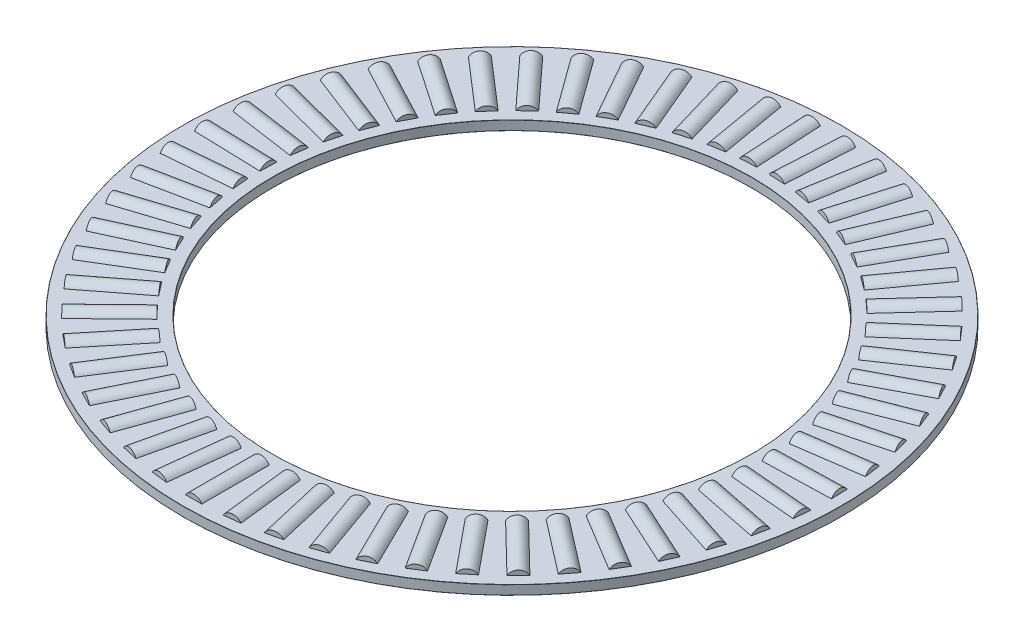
from build123d import *

# Parameters (mm, degrees)
SKETCH1_W         = 9.525
SKETCH1_H         = 0.9921875
SKETCH3_W         = 7.14375
SKETCH3_H         = 0.9921875
SKETCH2_W         = 7.14375
SKETCH2_H         = 0.9921875
CIRPATTERN1_COUNT = 55
CIRPATTERN1_ANGLE = 353.454545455
CIRPATTERN2_COUNT = 55
FILLET2_R         = 0.01984375


with BuildPart() as part:
    # Sketch1 → Revolve1 (revolve)
    with BuildSketch(Plane(origin=(0, 0, 0), x_dir=(0, 0, -1), z_dir=(1, 0, 0)), mode=Mode.PRIVATE) as revolve1_sk:
        with Locations((-30.1625, 0)):
            Rectangle(SKETCH1_W, SKETCH1_H)
    revolve(revolve1_sk.sketch.rotate(Axis((0, -0.9921875, 0), (0, 1, 0)), 180), axis=Axis((0, -0.9921875, 0), (0, 1, 0)))

    # Sketch3 → Cut-Revolve1 (revolve, cut)
    with BuildSketch(Plane(origin=(0, 0, 0), x_dir=(0, 0, -1), z_dir=(1, 0, 0))):
        with Locations((-30.1625, 0.49609375)):
            Rectangle(SKETCH3_W, SKETCH3_H)
    cut_revolve1 = revolve(axis=Axis((0, 0, 33.734375), (0, 0, -1)), mode=Mode.SUBTRACT)

    # CirPattern2: Cut-Revolve1 ×55 about axis
    cirpattern2_axis = Axis((0, 0, 0), (0, 1, 0))
    for i in range(1, CIRPATTERN2_COUNT):
        add(cut_revolve1.rotate(cirpattern2_axis, i * 360 / CIRPATTERN2_COUNT), mode=Mode.SUBTRACT)

    # Fillet2
    fillet2_edges = [part.edges().sort_by_distance(p)[0] for p in [
        (0, 0.49609375, 34.925),
        (0, 0.49609375, 25.4),
        (0, -0.49609375, 25.4),
        (0, -0.49609375, 34.925),
    ]]
    fillet(fillet2_edges, radius=FILLET2_R)


with BuildPart() as body_2:
    # Sketch2 → Revolve2 (revolve)
    with BuildSketch(Plane(origin=(0, 0, 0), x_dir=(0, 0, -1), z_dir=(1, 0, 0)), mode=Mode.PRIVATE) as revolve2_sk:
        with Locations((-30.1625, 0.49609375)):
            Rectangle(SKETCH2_W, SKETCH2_H)
    revolve(revolve2_sk.sketch.rotate(Axis((0, 0, 33.734375), (0, 0, -1)), 90), axis=Axis((0, 0, 33.734375), (0, 0, -1)))


with BuildPart() as cirpattern1_1:
    # CirPattern1: pattern copy
    add(body_2.part.rotate(Axis((0, 0.9921875, 0), (0, -1, 0)), 1 * CIRPATTERN1_ANGLE / (CIRPATTERN1_COUNT - 1)))


with BuildPart() as cirpattern1_2:
    # CirPattern1: pattern copy
    add(body_2.part.rotate(Axis((0, 0.9921875, 0), (0, -1, 0)), 2 * CIRPATTERN1_ANGLE / (CIRPATTERN1_COUNT - 1)))


with BuildPart() as cirpattern1_3:
    # CirPattern1: pattern copy
    add(body_2.part.rotate(Axis((0, 0.9921875, 0), (0, -1, 0)), 3 * CIRPATTERN1_ANGLE / (CIRPATTERN1_COUNT - 1)))


with BuildPart() as cirpattern1_4:
    # CirPattern1: pattern copy
    add(body_2.part.rotate(Axis((0, 0.9921875, 0), (0, -1, 0)), 4 * CIRPATTERN1_ANGLE / (CIRPATTERN1_COUNT - 1)))


with BuildPart() as cirpattern1_5:
    # CirPattern1: pattern copy
    add(body_2.part.rotate(Axis((0, 0.9921875, 0), (0, -1, 0)), 5 * CIRPATTERN1_ANGLE / (CIRPATTERN1_COUNT - 1)))


with BuildPart() as cirpattern1_6:
    # CirPattern1: pattern copy
    add(body_2.part.rotate(Axis((0, 0.9921875, 0), (0, -1, 0)), 6 * CIRPATTERN1_ANGLE / (CIRPATTERN1_COUNT - 1)))


with BuildPart() as cirpattern1_7:
    # CirPattern1: pattern copy
    add(body_2.part.rotate(Axis((0, 0.9921875, 0), (0, -1, 0)), 7 * CIRPATTERN1_ANGLE / (CIRPATTERN1_COUNT - 1)))


with BuildPart() as cirpattern1_8:
    # CirPattern1: pattern copy
    add(body_2.part.rotate(Axis((0, 0.9921875, 0), (0, -1, 0)), 8 * CIRPATTERN1_ANGLE / (CIRPATTERN1_COUNT - 1)))


with BuildPart() as cirpattern1_9:
    # CirPattern1: pattern copy
    add(body_2.part.rotate(Axis((0, 0.9921875, 0), (0, -1, 0)), 9 * CIRPATTERN1_ANGLE / (CIRPATTERN1_COUNT - 1)))


with BuildPart() as cirpattern1_10:
    # CirPattern1: pattern copy
    add(body_2.part.rotate(Axis((0, 0.9921875, 0), (0, -1, 0)), 10 * CIRPATTERN1_ANGLE / (CIRPATTERN1_COUNT - 1)))


with BuildPart() as cirpattern1_11:
    # CirPattern1: pattern copy
    add(body_2.part.rotate(Axis((0, 0.9921875, 0), (0, -1, 0)), 11 * CIRPATTERN1_ANGLE / (CIRPATTERN1_COUNT - 1)))


with BuildPart() as cirpattern1_12:
    # CirPattern1: pattern copy
    add(body_2.part.rotate(Axis((0, 0.9921875, 0), (0, -1, 0)), 12 * CIRPATTERN1_ANGLE / (CIRPATTERN1_COUNT - 1)))


with BuildPart() as cirpattern1_13:
    # CirPattern1: pattern copy
    add(body_2.part.rotate(Axis((0, 0.9921875, 0), (0, -1, 0)), 13 * CIRPATTERN1_ANGLE / (CIRPATTERN1_COUNT - 1)))


with BuildPart() as cirpattern1_14:
    # CirPattern1: pattern copy
    add(body_2.part.rotate(Axis((0, 0.9921875, 0), (0, -1, 0)), 14 * CIRPATTERN1_ANGLE / (CIRPATTERN1_COUNT - 1)))


with BuildPart() as cirpattern1_15:
    # CirPattern1: pattern copy
    add(body_2.part.rotate(Axis((0, 0.9921875, 0), (0, -1, 0)), 15 * CIRPATTERN1_ANGLE / (CIRPATTERN1_COUNT - 1)))


with BuildPart() as cirpattern1_16:
    # CirPattern1: pattern copy
    add(body_2.part.rotate(Axis((0, 0.9921875, 0), (0, -1, 0)), 16 * CIRPATTERN1_ANGLE / (CIRPATTERN1_COUNT - 1)))


with BuildPart() as cirpattern1_17:
    # CirPattern1: pattern copy
    add(body_2.part.rotate(Axis((0, 0.9921875, 0), (0, -1, 0)), 17 * CIRPATTERN1_ANGLE / (CIRPATTERN1_COUNT - 1)))


with BuildPart() as cirpattern1_18:
    # CirPattern1: pattern copy
    add(body_2.part.rotate(Axis((0, 0.9921875, 0), (0, -1, 0)), 18 * CIRPATTERN1_ANGLE / (CIRPATTERN1_COUNT - 1)))


with BuildPart() as cirpattern1_19:
    # CirPattern1: pattern copy
    add(body_2.part.rotate(Axis((0, 0.9921875, 0), (0, -1, 0)), 19 * CIRPATTERN1_ANGLE / (CIRPATTERN1_COUNT - 1)))


with BuildPart() as cirpattern1_20:
    # CirPattern1: pattern copy
    add(body_2.part.rotate(Axis((0, 0.9921875, 0), (0, -1, 0)), 20 * CIRPATTERN1_ANGLE / (CIRPATTERN1_COUNT - 1)))


with BuildPart() as cirpattern1_21:
    # CirPattern1: pattern copy
    add(body_2.part.rotate(Axis((0, 0.9921875, 0), (0, -1, 0)), 21 * CIRPATTERN1_ANGLE / (CIRPATTERN1_COUNT - 1)))


with BuildPart() as cirpattern1_22:
    # CirPattern1: pattern copy
    add(body_2.part.rotate(Axis((0, 0.9921875, 0), (0, -1, 0)), 22 * CIRPATTERN1_ANGLE / (CIRPATTERN1_COUNT - 1)))


with BuildPart() as cirpattern1_23:
    # CirPattern1: pattern copy
    add(body_2.part.rotate(Axis((0, 0.9921875, 0), (0, -1, 0)), 23 * CIRPATTERN1_ANGLE / (CIRPATTERN1_COUNT - 1)))


with BuildPart() as cirpattern1_24:
    # CirPattern1: pattern copy
    add(body_2.part.rotate(Axis((0, 0.9921875, 0), (0, -1, 0)), 24 * CIRPATTERN1_ANGLE / (CIRPATTERN1_COUNT - 1)))


with BuildPart() as cirpattern1_25:
    # CirPattern1: pattern copy
    add(body_2.part.rotate(Axis((0, 0.9921875, 0), (0, -1, 0)), 25 * CIRPATTERN1_ANGLE / (CIRPATTERN1_COUNT - 1)))


with BuildPart() as cirpattern1_26:
    # CirPattern1: pattern copy
    add(body_2.part.rotate(Axis((0, 0.9921875, 0), (0, -1, 0)), 26 * CIRPATTERN1_ANGLE / (CIRPATTERN1_COUNT - 1)))


with BuildPart() as cirpattern1_27:
    # CirPattern1: pattern copy
    add(body_2.part.rotate(Axis((0, 0.9921875, 0), (0, -1, 0)), 27 * CIRPATTERN1_ANGLE / (CIRPATTERN1_COUNT - 1)))


with BuildPart() as cirpattern1_28:
    # CirPattern1: pattern copy
    add(body_2.part.rotate(Axis((0, 0.9921875, 0), (0, -1, 0)), 28 * CIRPATTERN1_ANGLE / (CIRPATTERN1_COUNT - 1)))


with BuildPart() as cirpattern1_29:
    # CirPattern1: pattern copy
    add(body_2.part.rotate(Axis((0, 0.9921875, 0), (0, -1, 0)), 29 * CIRPATTERN1_ANGLE / (CIRPATTERN1_COUNT - 1)))


with BuildPart() as cirpattern1_30:
    # CirPattern1: pattern copy
    add(body_2.part.rotate(Axis((0, 0.9921875, 0), (0, -1, 0)), 30 * CIRPATTERN1_ANGLE / (CIRPATTERN1_COUNT - 1)))


with BuildPart() as cirpattern1_31:
    # CirPattern1: pattern copy
    add(body_2.part.rotate(Axis((0, 0.9921875, 0), (0, -1, 0)), 31 * CIRPATTERN1_ANGLE / (CIRPATTERN1_COUNT - 1)))


with BuildPart() as cirpattern1_32:
    # CirPattern1: pattern copy
    add(body_2.part.rotate(Axis((0, 0.9921875, 0), (0, -1, 0)), 32 * CIRPATTERN1_ANGLE / (CIRPATTERN1_COUNT - 1)))


with BuildPart() as cirpattern1_33:
    # CirPattern1: pattern copy
    add(body_2.part.rotate(Axis((0, 0.9921875, 0), (0, -1, 0)), 33 * CIRPATTERN1_ANGLE / (CIRPATTERN1_COUNT - 1)))


with BuildPart() as cirpattern1_34:
    # CirPattern1: pattern copy
    add(body_2.part.rotate(Axis((0, 0.9921875, 0), (0, -1, 0)), 34 * CIRPATTERN1_ANGLE / (CIRPATTERN1_COUNT - 1)))


with BuildPart() as cirpattern1_35:
    # CirPattern1: pattern copy
    add(body_2.part.rotate(Axis((0, 0.9921875, 0), (0, -1, 0)), 35 * CIRPATTERN1_ANGLE / (CIRPATTERN1_COUNT - 1)))


with BuildPart() as cirpattern1_36:
    # CirPattern1: pattern copy
    add(body_2.part.rotate(Axis((0, 0.9921875, 0), (0, -1, 0)), 36 * CIRPATTERN1_ANGLE / (CIRPATTERN1_COUNT - 1)))


with BuildPart() as cirpattern1_37:
    # CirPattern1: pattern copy
    add(body_2.part.rotate(Axis((0, 0.9921875, 0), (0, -1, 0)), 37 * CIRPATTERN1_ANGLE / (CIRPATTERN1_COUNT - 1)))


with BuildPart() as cirpattern1_38:
    # CirPattern1: pattern copy
    add(body_2.part.rotate(Axis((0, 0.9921875, 0), (0, -1, 0)), 38 * CIRPATTERN1_ANGLE / (CIRPATTERN1_COUNT - 1)))


with BuildPart() as cirpattern1_39:
    # CirPattern1: pattern copy
    add(body_2.part.rotate(Axis((0, 0.9921875, 0), (0, -1, 0)), 39 * CIRPATTERN1_ANGLE / (CIRPATTERN1_COUNT - 1)))


with BuildPart() as cirpattern1_40:
    # CirPattern1: pattern copy
    add(body_2.part.rotate(Axis((0, 0.9921875, 0), (0, -1, 0)), 40 * CIRPATTERN1_ANGLE / (CIRPATTERN1_COUNT - 1)))


with BuildPart() as cirpattern1_41:
    # CirPattern1: pattern copy
    add(body_2.part.rotate(Axis((0, 0.9921875, 0), (0, -1, 0)), 41 * CIRPATTERN1_ANGLE / (CIRPATTERN1_COUNT - 1)))


with BuildPart() as cirpattern1_42:
    # CirPattern1: pattern copy
    add(body_2.part.rotate(Axis((0, 0.9921875, 0), (0, -1, 0)), 42 * CIRPATTERN1_ANGLE / (CIRPATTERN1_COUNT - 1)))


with BuildPart() as cirpattern1_43:
    # CirPattern1: pattern copy
    add(body_2.part.rotate(Axis((0, 0.9921875, 0), (0, -1, 0)), 43 * CIRPATTERN1_ANGLE / (CIRPATTERN1_COUNT - 1)))


with BuildPart() as cirpattern1_44:
    # CirPattern1: pattern copy
    add(body_2.part.rotate(Axis((0, 0.9921875, 0), (0, -1, 0)), 44 * CIRPATTERN1_ANGLE / (CIRPATTERN1_COUNT - 1)))


with BuildPart() as cirpattern1_45:
    # CirPattern1: pattern copy
    add(body_2.part.rotate(Axis((0, 0.9921875, 0), (0, -1, 0)), 45 * CIRPATTERN1_ANGLE / (CIRPATTERN1_COUNT - 1)))


with BuildPart() as cirpattern1_46:
    # CirPattern1: pattern copy
    add(body_2.part.rotate(Axis((0, 0.9921875, 0), (0, -1, 0)), 46 * CIRPATTERN1_ANGLE / (CIRPATTERN1_COUNT - 1)))


with BuildPart() as cirpattern1_47:
    # CirPattern1: pattern copy
    add(body_2.part.rotate(Axis((0, 0.9921875, 0), (0, -1, 0)), 47 * CIRPATTERN1_ANGLE / (CIRPATTERN1_COUNT - 1)))


with BuildPart() as cirpattern1_48:
    # CirPattern1: pattern copy
    add(body_2.part.rotate(Axis((0, 0.9921875, 0), (0, -1, 0)), 48 * CIRPATTERN1_ANGLE / (CIRPATTERN1_COUNT - 1)))


with BuildPart() as cirpattern1_49:
    # CirPattern1: pattern copy
    add(body_2.part.rotate(Axis((0, 0.9921875, 0), (0, -1, 0)), 49 * CIRPATTERN1_ANGLE / (CIRPATTERN1_COUNT - 1)))


with BuildPart() as cirpattern1_50:
    # CirPattern1: pattern copy
    add(body_2.part.rotate(Axis((0, 0.9921875, 0), (0, -1, 0)), 50 * CIRPATTERN1_ANGLE / (CIRPATTERN1_COUNT - 1)))


with BuildPart() as cirpattern1_51:
    # CirPattern1: pattern copy
    add(body_2.part.rotate(Axis((0, 0.9921875, 0), (0, -1, 0)), 51 * CIRPATTERN1_ANGLE / (CIRPATTERN1_COUNT - 1)))


with BuildPart() as cirpattern1_52:
    # CirPattern1: pattern copy
    add(body_2.part.rotate(Axis((0, 0.9921875, 0), (0, -1, 0)), 52 * CIRPATTERN1_ANGLE / (CIRPATTERN1_COUNT - 1)))


with BuildPart() as cirpattern1_53:
    # CirPattern1: pattern copy
    add(body_2.part.rotate(Axis((0, 0.9921875, 0), (0, -1, 0)), 53 * CIRPATTERN1_ANGLE / (CIRPATTERN1_COUNT - 1)))


with BuildPart() as cirpattern1_54:
    # CirPattern1: pattern copy
    add(body_2.part.rotate(Axis((0, 0.9921875, 0), (0, -1, 0)), 54 * CIRPATTERN1_ANGLE / (CIRPATTERN1_COUNT - 1)))


solid = Compound([part.part, body_2.part, cirpattern1_1.part, cirpattern1_2.part, cirpattern1_3.part, cirpattern1_4.part, cirpattern1_5.part, cirpattern1_6.part, cirpattern1_7.part, cirpattern1_8.part, cirpattern1_9.part, cirpattern1_10.part, cirpattern1_11.part, cirpattern1_12.part, cirpattern1_13.part, cirpattern1_14.part, cirpattern1_15.part, cirpattern1_16.part, cirpattern1_17.part, cirpattern1_18.part, cirpattern1_19.part, cirpattern1_20.part, cirpattern1_21.part, cirpattern1_22.part, cirpattern1_23.part, cirpattern1_24.part, cirpattern1_25.part, cirpattern1_26.part, cirpattern1_27.part, cirpattern1_28.part, cirpattern1_29.part, cirpattern1_30.part, cirpattern1_31.part, cirpattern1_32.part, cirpattern1_33.part, cirpattern1_34.part, cirpattern1_35.part, cirpattern1_36.part, cirpattern1_37.part, cirpattern1_38.part, cirpattern1_39.part, cirpattern1_40.part, cirpattern1_41.part, cirpattern1_42.part, cirpattern1_43.part, cirpattern1_44.part, cirpattern1_45.part, cirpattern1_46.part, cirpattern1_47.part, cirpattern1_48.part, cirpattern1_49.part, cirpattern1_50.part, cirpattern1_51.part, cirpattern1_52.part, cirpattern1_53.part, cirpattern1_54.part])
